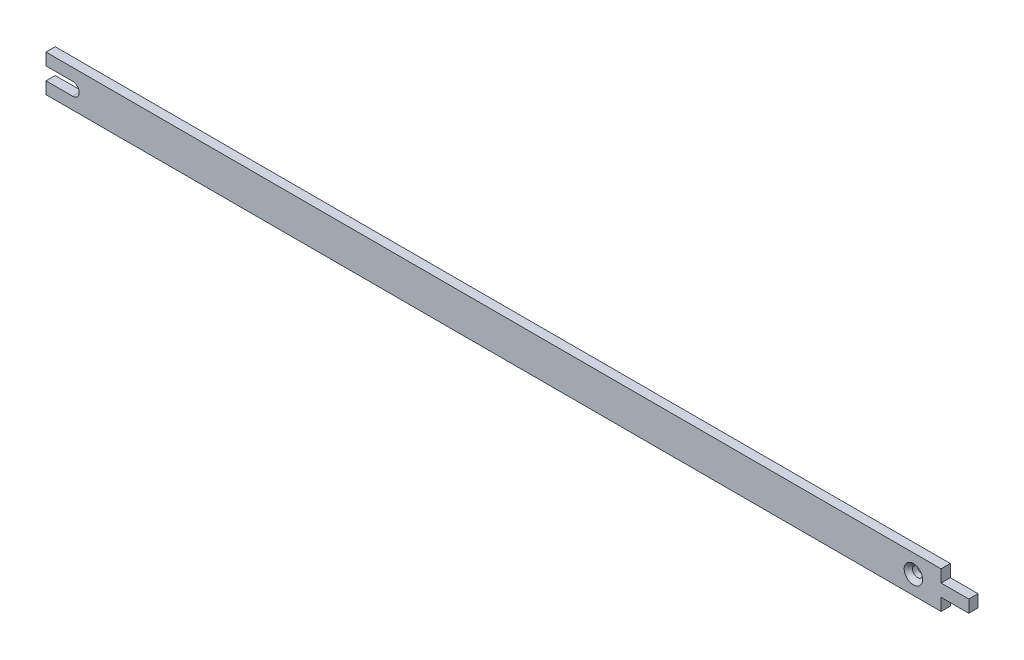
ISO-10303-21;
HEADER;
FILE_DESCRIPTION(('STEP AP214'),'2;1');
FILE_NAME('part.step','',(''),(''),'','','');
FILE_SCHEMA(('AUTOMOTIVE_DESIGN { 1 0 10303 214 1 1 1 1 }'));
ENDSEC;
DATA;
#1=APPLICATION_CONTEXT('core data for automotive mechanical design processes');
#2=APPLICATION_PROTOCOL_DEFINITION('international standard','automotive_design',2000,#1);
#3=PRODUCT_CONTEXT('',#1,'mechanical');
#4=PRODUCT('Part','Part','',(#3));
#5=PRODUCT_RELATED_PRODUCT_CATEGORY('part','',(#4));
#6=PRODUCT_DEFINITION_FORMATION('','',#4);
#7=PRODUCT_DEFINITION_CONTEXT('part definition',#1,'design');
#8=PRODUCT_DEFINITION('design','',#6,#7);
#9=PRODUCT_DEFINITION_SHAPE('','',#8);
#10=(LENGTH_UNIT() NAMED_UNIT(*) SI_UNIT(.MILLI.,.METRE.));
#11=(NAMED_UNIT(*) PLANE_ANGLE_UNIT() SI_UNIT($,.RADIAN.));
#12=(NAMED_UNIT(*) SI_UNIT($,.STERADIAN.) SOLID_ANGLE_UNIT());
#13=UNCERTAINTY_MEASURE_WITH_UNIT(LENGTH_MEASURE(1.E-05),#10,'distance_accuracy_value','');
#14=(GEOMETRIC_REPRESENTATION_CONTEXT(3) GLOBAL_UNCERTAINTY_ASSIGNED_CONTEXT((#13)) GLOBAL_UNIT_ASSIGNED_CONTEXT((#10,
#11,#12)) REPRESENTATION_CONTEXT('',''));
#15=CARTESIAN_POINT('',(0.,0.,0.));
#16=DIRECTION('',(0.,0.,1.));
#17=DIRECTION('',(1.,0.,0.));
#18=AXIS2_PLACEMENT_3D('',#15,#16,#17);
#19=CARTESIAN_POINT('',(15.,3.5,5.));
#20=DIRECTION('',(0.,0.,1.));
#21=DIRECTION('',(0.,1.,0.));
#22=AXIS2_PLACEMENT_3D('',#19,#20,#21);
#23=PLANE('',#22);
#24=DIRECTION('',(0.,1.,0.));
#25=VECTOR('',#24,1.);
#26=CARTESIAN_POINT('',(-470.,-13.7122625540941,5.));
#27=LINE('',#26,#25);
#28=CARTESIAN_POINT('',(-470.,-10.,5.));
#29=VERTEX_POINT('',#28);
#30=CARTESIAN_POINT('',(-470.,-3.5,5.));
#31=VERTEX_POINT('',#30);
#32=EDGE_CURVE('E105',#29,#31,#27,.T.);
#33=ORIENTED_EDGE('',*,*,#32,.F.);
#34=DIRECTION('',(1.,0.,0.));
#35=VECTOR('',#34,1.);
#36=CARTESIAN_POINT('',(15.,-10.,5.));
#37=LINE('',#36,#35);
#38=CARTESIAN_POINT('',(15.,-10.,5.));
#39=VERTEX_POINT('',#38);
#40=EDGE_CURVE('E116',#29,#39,#37,.T.);
#41=ORIENTED_EDGE('',*,*,#40,.T.);
#42=DIRECTION('',(0.,1.,0.));
#43=VECTOR('',#42,1.);
#44=CARTESIAN_POINT('',(15.,-3.35,5.));
#45=LINE('',#44,#43);
#46=CARTESIAN_POINT('',(15.,-3.35,5.));
#47=VERTEX_POINT('',#46);
#48=EDGE_CURVE('E128',#39,#47,#45,.T.);
#49=ORIENTED_EDGE('',*,*,#48,.T.);
#50=DIRECTION('',(1.,0.,0.));
#51=VECTOR('',#50,1.);
#52=CARTESIAN_POINT('',(30.,-3.35,5.));
#53=LINE('',#52,#51);
#54=CARTESIAN_POINT('',(30.,-3.35,5.));
#55=VERTEX_POINT('',#54);
#56=EDGE_CURVE('E131',#47,#55,#53,.T.);
#57=ORIENTED_EDGE('',*,*,#56,.T.);
#58=DIRECTION('',(0.,1.,0.));
#59=VECTOR('',#58,1.);
#60=CARTESIAN_POINT('',(30.,-3.35,5.));
#61=LINE('',#60,#59);
#62=CARTESIAN_POINT('',(30.,3.35,5.));
#63=VERTEX_POINT('',#62);
#64=EDGE_CURVE('E34',#55,#63,#61,.T.);
#65=ORIENTED_EDGE('',*,*,#64,.T.);
#66=DIRECTION('',(-1.,0.,0.));
#67=VECTOR('',#66,1.);
#68=CARTESIAN_POINT('',(30.,3.35,5.));
#69=LINE('',#68,#67);
#70=CARTESIAN_POINT('',(15.,3.35,5.));
#71=VERTEX_POINT('',#70);
#72=EDGE_CURVE('E29',#63,#71,#69,.T.);
#73=ORIENTED_EDGE('',*,*,#72,.T.);
#74=DIRECTION('',(0.,1.,0.));
#75=VECTOR('',#74,1.);
#76=CARTESIAN_POINT('',(15.,3.35,5.));
#77=LINE('',#76,#75);
#78=CARTESIAN_POINT('',(15.,10.,5.));
#79=VERTEX_POINT('',#78);
#80=EDGE_CURVE('E134',#71,#79,#77,.T.);
#81=ORIENTED_EDGE('',*,*,#80,.T.);
#82=DIRECTION('',(-1.,0.,0.));
#83=VECTOR('',#82,1.);
#84=CARTESIAN_POINT('',(15.,10.,5.));
#85=LINE('',#84,#83);
#86=CARTESIAN_POINT('',(-470.,10.,5.));
#87=VERTEX_POINT('',#86);
#88=EDGE_CURVE('E129',#79,#87,#85,.T.);
#89=ORIENTED_EDGE('',*,*,#88,.T.);
#90=CARTESIAN_POINT('',(-470.,3.5,5.));
#91=VERTEX_POINT('',#90);
#92=EDGE_CURVE('E122',#91,#87,#27,.T.);
#93=ORIENTED_EDGE('',*,*,#92,.F.);
#94=DIRECTION('',(-1.,0.,0.));
#95=VECTOR('',#94,1.);
#96=CARTESIAN_POINT('',(-470.,3.5,5.));
#97=LINE('',#96,#95);
#98=CARTESIAN_POINT('',(-455.5,3.5,5.));
#99=VERTEX_POINT('',#98);
#100=EDGE_CURVE('E267',#99,#91,#97,.T.);
#101=ORIENTED_EDGE('',*,*,#100,.F.);
#102=CARTESIAN_POINT('',(-455.5,0.,5.));
#103=DIRECTION('',(0.,0.,1.));
#104=DIRECTION('',(-1.,0.,0.));
#105=AXIS2_PLACEMENT_3D('',#102,#103,#104);
#106=CIRCLE('',#105,3.5);
#107=CARTESIAN_POINT('',(-455.5,-3.5,5.));
#108=VERTEX_POINT('',#107);
#109=EDGE_CURVE('E264',#108,#99,#106,.T.);
#110=ORIENTED_EDGE('',*,*,#109,.F.);
#111=DIRECTION('',(1.,0.,0.));
#112=VECTOR('',#111,1.);
#113=CARTESIAN_POINT('',(-455.5,-3.5,5.));
#114=LINE('',#113,#112);
#115=EDGE_CURVE('E120',#31,#108,#114,.T.);
#116=ORIENTED_EDGE('',*,*,#115,.F.);
#117=EDGE_LOOP('',(#33,#41,#49,#57,#65,#73,#81,#89,#93,#101,#110,#116));
#118=FACE_BOUND('',#117,.T.);
#119=CARTESIAN_POINT('',(0.,0.,5.));
#120=DIRECTION('',(0.,0.,1.));
#121=DIRECTION('',(0.,1.,0.));
#122=AXIS2_PLACEMENT_3D('',#119,#120,#121);
#123=CIRCLE('',#122,5.);
#124=CARTESIAN_POINT('',(0.,5.,5.));
#125=VERTEX_POINT('',#124);
#126=EDGE_CURVE('E9',#125,#125,#123,.F.);
#127=ORIENTED_EDGE('',*,*,#126,.T.);
#128=EDGE_LOOP('',(#127));
#129=FACE_BOUND('',#128,.T.);
#130=ADVANCED_FACE('F14',(#118,#129),#23,.T.);
#131=CARTESIAN_POINT('',(15.,3.5,0.));
#132=DIRECTION('',(0.,0.,1.));
#133=DIRECTION('',(0.,1.,0.));
#134=AXIS2_PLACEMENT_3D('',#131,#132,#133);
#135=PLANE('',#134);
#136=DIRECTION('',(1.,0.,0.));
#137=VECTOR('',#136,1.);
#138=CARTESIAN_POINT('',(15.,-10.,0.));
#139=LINE('',#138,#137);
#140=CARTESIAN_POINT('',(-470.,-10.,0.));
#141=VERTEX_POINT('',#140);
#142=CARTESIAN_POINT('',(15.,-10.,0.));
#143=VERTEX_POINT('',#142);
#144=EDGE_CURVE('E220',#141,#143,#139,.T.);
#145=ORIENTED_EDGE('',*,*,#144,.F.);
#146=DIRECTION('',(0.,1.,0.));
#147=VECTOR('',#146,1.);
#148=CARTESIAN_POINT('',(-470.,-13.7122625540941,0.));
#149=LINE('',#148,#147);
#150=CARTESIAN_POINT('',(-470.,-3.5,0.));
#151=VERTEX_POINT('',#150);
#152=EDGE_CURVE('E108',#141,#151,#149,.T.);
#153=ORIENTED_EDGE('',*,*,#152,.T.);
#154=DIRECTION('',(1.,0.,0.));
#155=VECTOR('',#154,1.);
#156=CARTESIAN_POINT('',(-455.5,-3.5,0.));
#157=LINE('',#156,#155);
#158=CARTESIAN_POINT('',(-455.5,-3.5,0.));
#159=VERTEX_POINT('',#158);
#160=EDGE_CURVE('E248',#151,#159,#157,.T.);
#161=ORIENTED_EDGE('',*,*,#160,.T.);
#162=CARTESIAN_POINT('',(-455.5,0.,0.));
#163=DIRECTION('',(0.,0.,1.));
#164=DIRECTION('',(-1.,0.,0.));
#165=AXIS2_PLACEMENT_3D('',#162,#163,#164);
#166=CIRCLE('',#165,3.5);
#167=CARTESIAN_POINT('',(-455.5,3.5,0.));
#168=VERTEX_POINT('',#167);
#169=EDGE_CURVE('E260',#159,#168,#166,.T.);
#170=ORIENTED_EDGE('',*,*,#169,.T.);
#171=DIRECTION('',(-1.,0.,0.));
#172=VECTOR('',#171,1.);
#173=CARTESIAN_POINT('',(-470.,3.5,0.));
#174=LINE('',#173,#172);
#175=CARTESIAN_POINT('',(-470.,3.5,0.));
#176=VERTEX_POINT('',#175);
#177=EDGE_CURVE('E255',#168,#176,#174,.T.);
#178=ORIENTED_EDGE('',*,*,#177,.T.);
#179=CARTESIAN_POINT('',(-470.,10.,0.));
#180=VERTEX_POINT('',#179);
#181=EDGE_CURVE('E121',#176,#180,#149,.T.);
#182=ORIENTED_EDGE('',*,*,#181,.T.);
#183=DIRECTION('',(-1.,0.,0.));
#184=VECTOR('',#183,1.);
#185=CARTESIAN_POINT('',(15.,10.,0.));
#186=LINE('',#185,#184);
#187=CARTESIAN_POINT('',(15.,10.,0.));
#188=VERTEX_POINT('',#187);
#189=EDGE_CURVE('E215',#188,#180,#186,.T.);
#190=ORIENTED_EDGE('',*,*,#189,.F.);
#191=DIRECTION('',(0.,1.,0.));
#192=VECTOR('',#191,1.);
#193=CARTESIAN_POINT('',(15.,3.35,0.));
#194=LINE('',#193,#192);
#195=CARTESIAN_POINT('',(15.,3.35,0.));
#196=VERTEX_POINT('',#195);
#197=EDGE_CURVE('E221',#196,#188,#194,.T.);
#198=ORIENTED_EDGE('',*,*,#197,.F.);
#199=DIRECTION('',(-1.,0.,0.));
#200=VECTOR('',#199,1.);
#201=CARTESIAN_POINT('',(30.,3.35,0.));
#202=LINE('',#201,#200);
#203=CARTESIAN_POINT('',(30.,3.35,0.));
#204=VERTEX_POINT('',#203);
#205=EDGE_CURVE('E234',#204,#196,#202,.T.);
#206=ORIENTED_EDGE('',*,*,#205,.F.);
#207=DIRECTION('',(0.,1.,0.));
#208=VECTOR('',#207,1.);
#209=CARTESIAN_POINT('',(30.,-3.35,0.));
#210=LINE('',#209,#208);
#211=CARTESIAN_POINT('',(30.,-3.35,0.));
#212=VERTEX_POINT('',#211);
#213=EDGE_CURVE('E232',#212,#204,#210,.T.);
#214=ORIENTED_EDGE('',*,*,#213,.F.);
#215=DIRECTION('',(1.,0.,0.));
#216=VECTOR('',#215,1.);
#217=CARTESIAN_POINT('',(30.,-3.35,0.));
#218=LINE('',#217,#216);
#219=CARTESIAN_POINT('',(15.,-3.35,0.));
#220=VERTEX_POINT('',#219);
#221=EDGE_CURVE('E230',#220,#212,#218,.T.);
#222=ORIENTED_EDGE('',*,*,#221,.F.);
#223=DIRECTION('',(0.,1.,0.));
#224=VECTOR('',#223,1.);
#225=CARTESIAN_POINT('',(15.,-3.35,0.));
#226=LINE('',#225,#224);
#227=EDGE_CURVE('E223',#143,#220,#226,.T.);
#228=ORIENTED_EDGE('',*,*,#227,.F.);
#229=EDGE_LOOP('',(#145,#153,#161,#170,#178,#182,#190,#198,#206,#214,#222,#228));
#230=FACE_BOUND('',#229,.T.);
#231=CARTESIAN_POINT('',(0.,0.,0.));
#232=DIRECTION('',(0.,0.,1.));
#233=DIRECTION('',(0.,1.,0.));
#234=AXIS2_PLACEMENT_3D('',#231,#232,#233);
#235=CIRCLE('',#234,2.75);
#236=CARTESIAN_POINT('',(0.,2.75,0.));
#237=VERTEX_POINT('',#236);
#238=EDGE_CURVE('E225',#237,#237,#235,.T.);
#239=ORIENTED_EDGE('',*,*,#238,.T.);
#240=EDGE_LOOP('',(#239));
#241=FACE_BOUND('',#240,.T.);
#242=ADVANCED_FACE('F180',(#230,#241),#135,.F.);
#243=CARTESIAN_POINT('',(15.,3.35,5.));
#244=DIRECTION('',(-1.,0.,0.));
#245=DIRECTION('',(0.,-1.,0.));
#246=AXIS2_PLACEMENT_3D('',#243,#244,#245);
#247=PLANE('',#246);
#248=ORIENTED_EDGE('',*,*,#197,.T.);
#249=DIRECTION('',(0.,0.,-1.));
#250=VECTOR('',#249,1.);
#251=CARTESIAN_POINT('',(15.,10.,5.));
#252=LINE('',#251,#250);
#253=EDGE_CURVE('E154',#79,#188,#252,.T.);
#254=ORIENTED_EDGE('',*,*,#253,.F.);
#255=ORIENTED_EDGE('',*,*,#80,.F.);
#256=DIRECTION('',(0.,0.,-1.));
#257=VECTOR('',#256,1.);
#258=CARTESIAN_POINT('',(15.,3.35,5.));
#259=LINE('',#258,#257);
#260=EDGE_CURVE('E141',#71,#196,#259,.T.);
#261=ORIENTED_EDGE('',*,*,#260,.T.);
#262=EDGE_LOOP('',(#248,#254,#255,#261));
#263=FACE_BOUND('',#262,.T.);
#264=ADVANCED_FACE('F16',(#263),#247,.F.);
#265=CARTESIAN_POINT('',(15.,10.,5.));
#266=DIRECTION('',(0.,-1.,0.));
#267=DIRECTION('',(1.,0.,0.));
#268=AXIS2_PLACEMENT_3D('',#265,#266,#267);
#269=PLANE('',#268);
#270=ORIENTED_EDGE('',*,*,#189,.T.);
#271=DIRECTION('',(0.,0.,1.));
#272=VECTOR('',#271,1.);
#273=CARTESIAN_POINT('',(-470.,10.,5.));
#274=LINE('',#273,#272);
#275=EDGE_CURVE('E112',#180,#87,#274,.T.);
#276=ORIENTED_EDGE('',*,*,#275,.T.);
#277=ORIENTED_EDGE('',*,*,#88,.F.);
#278=ORIENTED_EDGE('',*,*,#253,.T.);
#279=EDGE_LOOP('',(#270,#276,#277,#278));
#280=FACE_BOUND('',#279,.T.);
#281=ADVANCED_FACE('F205',(#280),#269,.F.);
#282=CARTESIAN_POINT('',(15.,-10.,5.));
#283=DIRECTION('',(0.,1.,0.));
#284=DIRECTION('',(-1.,0.,0.));
#285=AXIS2_PLACEMENT_3D('',#282,#283,#284);
#286=PLANE('',#285);
#287=ORIENTED_EDGE('',*,*,#40,.F.);
#288=DIRECTION('',(0.,0.,-1.));
#289=VECTOR('',#288,1.);
#290=CARTESIAN_POINT('',(-470.,-10.,5.));
#291=LINE('',#290,#289);
#292=EDGE_CURVE('E102',#29,#141,#291,.T.);
#293=ORIENTED_EDGE('',*,*,#292,.T.);
#294=ORIENTED_EDGE('',*,*,#144,.T.);
#295=DIRECTION('',(0.,0.,-1.));
#296=VECTOR('',#295,1.);
#297=CARTESIAN_POINT('',(15.,-10.,5.));
#298=LINE('',#297,#296);
#299=EDGE_CURVE('E126',#39,#143,#298,.T.);
#300=ORIENTED_EDGE('',*,*,#299,.F.);
#301=EDGE_LOOP('',(#287,#293,#294,#300));
#302=FACE_BOUND('',#301,.T.);
#303=ADVANCED_FACE('F124',(#302),#286,.F.);
#304=CARTESIAN_POINT('',(15.,-3.35,5.));
#305=DIRECTION('',(-1.,0.,0.));
#306=DIRECTION('',(0.,-1.,0.));
#307=AXIS2_PLACEMENT_3D('',#304,#305,#306);
#308=PLANE('',#307);
#309=ORIENTED_EDGE('',*,*,#227,.T.);
#310=DIRECTION('',(0.,0.,-1.));
#311=VECTOR('',#310,1.);
#312=CARTESIAN_POINT('',(15.,-3.35,5.));
#313=LINE('',#312,#311);
#314=EDGE_CURVE('E150',#47,#220,#313,.T.);
#315=ORIENTED_EDGE('',*,*,#314,.F.);
#316=ORIENTED_EDGE('',*,*,#48,.F.);
#317=ORIENTED_EDGE('',*,*,#299,.T.);
#318=EDGE_LOOP('',(#309,#315,#316,#317));
#319=FACE_BOUND('',#318,.T.);
#320=ADVANCED_FACE('F199',(#319),#308,.F.);
#321=CARTESIAN_POINT('',(30.,-3.35,5.));
#322=DIRECTION('',(0.,1.,0.));
#323=DIRECTION('',(-1.,0.,0.));
#324=AXIS2_PLACEMENT_3D('',#321,#322,#323);
#325=PLANE('',#324);
#326=ORIENTED_EDGE('',*,*,#221,.T.);
#327=DIRECTION('',(0.,0.,-1.));
#328=VECTOR('',#327,1.);
#329=CARTESIAN_POINT('',(30.,-3.35,5.));
#330=LINE('',#329,#328);
#331=EDGE_CURVE('E147',#55,#212,#330,.T.);
#332=ORIENTED_EDGE('',*,*,#331,.F.);
#333=ORIENTED_EDGE('',*,*,#56,.F.);
#334=ORIENTED_EDGE('',*,*,#314,.T.);
#335=EDGE_LOOP('',(#326,#332,#333,#334));
#336=FACE_BOUND('',#335,.T.);
#337=ADVANCED_FACE('F195',(#336),#325,.F.);
#338=CARTESIAN_POINT('',(30.,-3.35,5.));
#339=DIRECTION('',(-1.,0.,0.));
#340=DIRECTION('',(0.,-1.,0.));
#341=AXIS2_PLACEMENT_3D('',#338,#339,#340);
#342=PLANE('',#341);
#343=ORIENTED_EDGE('',*,*,#213,.T.);
#344=DIRECTION('',(0.,0.,-1.));
#345=VECTOR('',#344,1.);
#346=CARTESIAN_POINT('',(30.,3.35,5.));
#347=LINE('',#346,#345);
#348=EDGE_CURVE('E144',#63,#204,#347,.T.);
#349=ORIENTED_EDGE('',*,*,#348,.F.);
#350=ORIENTED_EDGE('',*,*,#64,.F.);
#351=ORIENTED_EDGE('',*,*,#331,.T.);
#352=EDGE_LOOP('',(#343,#349,#350,#351));
#353=FACE_BOUND('',#352,.T.);
#354=ADVANCED_FACE('F191',(#353),#342,.F.);
#355=CARTESIAN_POINT('',(30.,3.35,5.));
#356=DIRECTION('',(0.,-1.,0.));
#357=DIRECTION('',(1.,0.,0.));
#358=AXIS2_PLACEMENT_3D('',#355,#356,#357);
#359=PLANE('',#358);
#360=ORIENTED_EDGE('',*,*,#205,.T.);
#361=ORIENTED_EDGE('',*,*,#260,.F.);
#362=ORIENTED_EDGE('',*,*,#72,.F.);
#363=ORIENTED_EDGE('',*,*,#348,.T.);
#364=EDGE_LOOP('',(#360,#361,#362,#363));
#365=FACE_BOUND('',#364,.T.);
#366=ADVANCED_FACE('F176',(#365),#359,.F.);
#367=CARTESIAN_POINT('',(0.,0.,5.));
#368=DIRECTION('',(0.,0.,-1.));
#369=DIRECTION('',(0.,-1.,0.));
#370=AXIS2_PLACEMENT_3D('',#367,#368,#369);
#371=CYLINDRICAL_SURFACE('',#370,2.75);
#372=CARTESIAN_POINT('',(0.,0.,2.75));
#373=DIRECTION('',(0.,0.,1.));
#374=DIRECTION('',(0.,1.,0.));
#375=AXIS2_PLACEMENT_3D('',#372,#373,#374);
#376=CIRCLE('',#375,2.75);
#377=CARTESIAN_POINT('',(0.,2.75,2.75));
#378=VERTEX_POINT('',#377);
#379=EDGE_CURVE('E22',#378,#378,#376,.T.);
#380=ORIENTED_EDGE('',*,*,#379,.T.);
#381=EDGE_LOOP('',(#380));
#382=FACE_BOUND('',#381,.T.);
#383=ORIENTED_EDGE('',*,*,#238,.F.);
#384=EDGE_LOOP('',(#383));
#385=FACE_BOUND('',#384,.T.);
#386=ADVANCED_FACE('F159',(#382,#385),#371,.F.);
#387=CARTESIAN_POINT('',(0.,0.,2.75));
#388=DIRECTION('',(0.,0.,1.));
#389=DIRECTION('',(0.,1.,0.));
#390=AXIS2_PLACEMENT_3D('',#387,#388,#389);
#391=CONICAL_SURFACE('',#390,2.75,0.78539816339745);
#392=ORIENTED_EDGE('',*,*,#126,.F.);
#393=EDGE_LOOP('',(#392));
#394=FACE_BOUND('',#393,.T.);
#395=ORIENTED_EDGE('',*,*,#379,.F.);
#396=EDGE_LOOP('',(#395));
#397=FACE_BOUND('',#396,.T.);
#398=ADVANCED_FACE('F162',(#394,#397),#391,.F.);
#399=CARTESIAN_POINT('',(-455.5,0.,0.));
#400=DIRECTION('',(0.,0.,1.));
#401=DIRECTION('',(-1.,0.,0.));
#402=AXIS2_PLACEMENT_3D('',#399,#400,#401);
#403=CYLINDRICAL_SURFACE('',#402,3.5);
#404=ORIENTED_EDGE('',*,*,#109,.T.);
#405=DIRECTION('',(0.,0.,1.));
#406=VECTOR('',#405,1.);
#407=CARTESIAN_POINT('',(-455.5,3.5,0.));
#408=LINE('',#407,#406);
#409=EDGE_CURVE('E254',#168,#99,#408,.T.);
#410=ORIENTED_EDGE('',*,*,#409,.F.);
#411=ORIENTED_EDGE('',*,*,#169,.F.);
#412=DIRECTION('',(0.,0.,1.));
#413=VECTOR('',#412,1.);
#414=CARTESIAN_POINT('',(-455.5,-3.5,0.));
#415=LINE('',#414,#413);
#416=EDGE_CURVE('E252',#159,#108,#415,.T.);
#417=ORIENTED_EDGE('',*,*,#416,.T.);
#418=EDGE_LOOP('',(#404,#410,#411,#417));
#419=FACE_BOUND('',#418,.T.);
#420=ADVANCED_FACE('F164',(#419),#403,.F.);
#421=CARTESIAN_POINT('',(-455.5,-3.5,0.));
#422=DIRECTION('',(0.,-1.,0.));
#423=DIRECTION('',(0.,0.,1.));
#424=AXIS2_PLACEMENT_3D('',#421,#422,#423);
#425=PLANE('',#424);
#426=ORIENTED_EDGE('',*,*,#115,.T.);
#427=ORIENTED_EDGE('',*,*,#416,.F.);
#428=ORIENTED_EDGE('',*,*,#160,.F.);
#429=DIRECTION('',(0.,0.,1.));
#430=VECTOR('',#429,1.);
#431=CARTESIAN_POINT('',(-470.,-3.5,0.));
#432=LINE('',#431,#430);
#433=EDGE_CURVE('E251',#151,#31,#432,.T.);
#434=ORIENTED_EDGE('',*,*,#433,.T.);
#435=EDGE_LOOP('',(#426,#427,#428,#434));
#436=FACE_BOUND('',#435,.T.);
#437=ADVANCED_FACE('F173',(#436),#425,.F.);
#438=CARTESIAN_POINT('',(-470.,3.5,0.));
#439=DIRECTION('',(0.,1.,0.));
#440=DIRECTION('',(0.,0.,-1.));
#441=AXIS2_PLACEMENT_3D('',#438,#439,#440);
#442=PLANE('',#441);
#443=ORIENTED_EDGE('',*,*,#100,.T.);
#444=DIRECTION('',(0.,0.,1.));
#445=VECTOR('',#444,1.);
#446=CARTESIAN_POINT('',(-470.,3.5,0.));
#447=LINE('',#446,#445);
#448=EDGE_CURVE('E257',#176,#91,#447,.T.);
#449=ORIENTED_EDGE('',*,*,#448,.F.);
#450=ORIENTED_EDGE('',*,*,#177,.F.);
#451=ORIENTED_EDGE('',*,*,#409,.T.);
#452=EDGE_LOOP('',(#443,#449,#450,#451));
#453=FACE_BOUND('',#452,.T.);
#454=ADVANCED_FACE('F281',(#453),#442,.F.);
#455=CARTESIAN_POINT('',(-470.,-13.7122625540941,0.));
#456=DIRECTION('',(1.,0.,0.));
#457=DIRECTION('',(0.,0.,1.));
#458=AXIS2_PLACEMENT_3D('',#455,#456,#457);
#459=PLANE('',#458);
#460=ORIENTED_EDGE('',*,*,#181,.F.);
#461=ORIENTED_EDGE('',*,*,#448,.T.);
#462=ORIENTED_EDGE('',*,*,#92,.T.);
#463=ORIENTED_EDGE('',*,*,#275,.F.);
#464=EDGE_LOOP('',(#460,#461,#462,#463));
#465=FACE_BOUND('',#464,.T.);
#466=ADVANCED_FACE('F277',(#465),#459,.F.);
#467=ORIENTED_EDGE('',*,*,#32,.T.);
#468=ORIENTED_EDGE('',*,*,#433,.F.);
#469=ORIENTED_EDGE('',*,*,#152,.F.);
#470=ORIENTED_EDGE('',*,*,#292,.F.);
#471=EDGE_LOOP('',(#467,#468,#469,#470));
#472=FACE_BOUND('',#471,.T.);
#473=ADVANCED_FACE('F104',(#472),#459,.F.);
#474=CLOSED_SHELL('',(#130,#242,#264,#281,#303,#320,#337,#354,#366,#386,#398,#420,#437,#454,
#466,#473));
#475=MANIFOLD_SOLID_BREP('B1',#474);
#476=ADVANCED_BREP_SHAPE_REPRESENTATION('',(#18,#475),#14);
#477=SHAPE_DEFINITION_REPRESENTATION(#9,#476);
ENDSEC;
END-ISO-10303-21;
